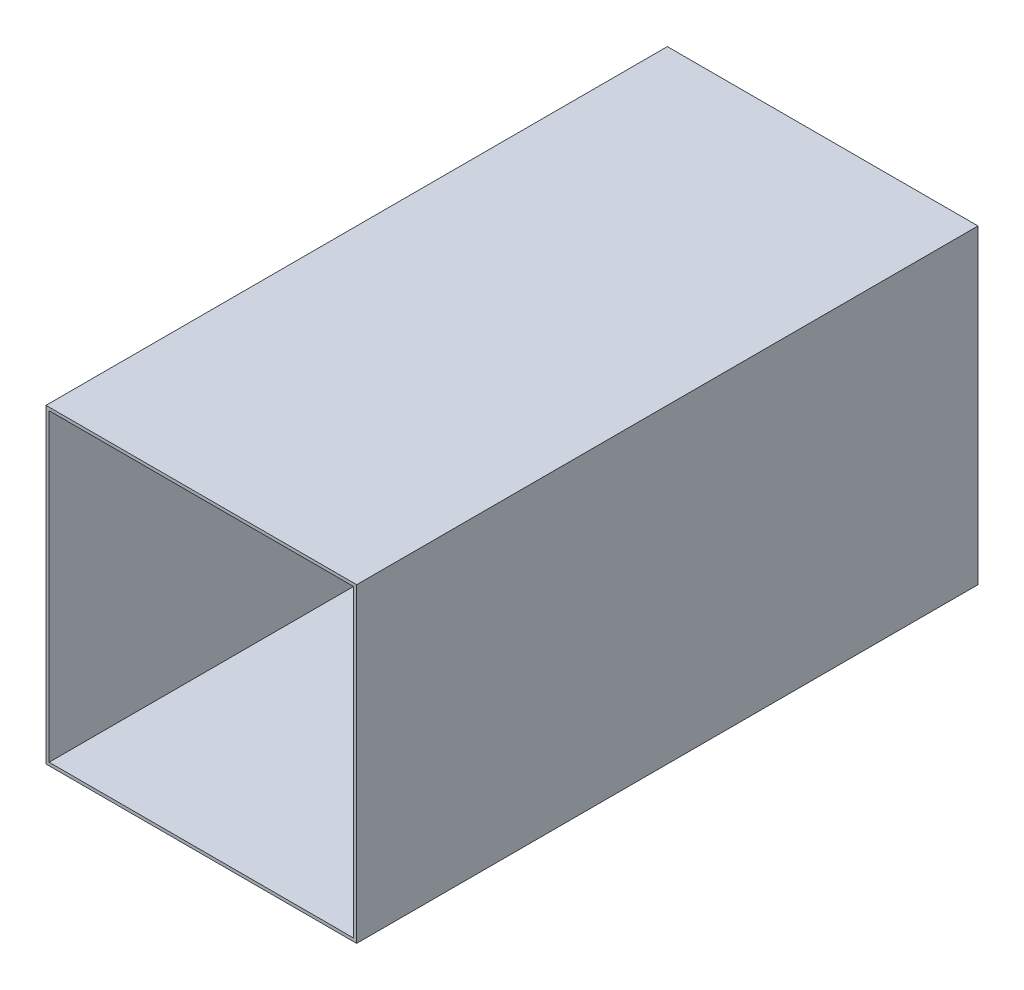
ISO-10303-21;
HEADER;
FILE_DESCRIPTION(('STEP AP214'),'2;1');
FILE_NAME('part.step','',(''),(''),'','','');
FILE_SCHEMA(('AUTOMOTIVE_DESIGN { 1 0 10303 214 1 1 1 1 }'));
ENDSEC;
DATA;
#1=APPLICATION_CONTEXT('core data for automotive mechanical design processes');
#2=APPLICATION_PROTOCOL_DEFINITION('international standard','automotive_design',2000,#1);
#3=PRODUCT_CONTEXT('',#1,'mechanical');
#4=PRODUCT('Part','Part','',(#3));
#5=PRODUCT_RELATED_PRODUCT_CATEGORY('part','',(#4));
#6=PRODUCT_DEFINITION_FORMATION('','',#4);
#7=PRODUCT_DEFINITION_CONTEXT('part definition',#1,'design');
#8=PRODUCT_DEFINITION('design','',#6,#7);
#9=PRODUCT_DEFINITION_SHAPE('','',#8);
#10=(LENGTH_UNIT() NAMED_UNIT(*) SI_UNIT(.MILLI.,.METRE.));
#11=(NAMED_UNIT(*) PLANE_ANGLE_UNIT() SI_UNIT($,.RADIAN.));
#12=(NAMED_UNIT(*) SI_UNIT($,.STERADIAN.) SOLID_ANGLE_UNIT());
#13=UNCERTAINTY_MEASURE_WITH_UNIT(LENGTH_MEASURE(1.E-05),#10,'distance_accuracy_value','');
#14=(GEOMETRIC_REPRESENTATION_CONTEXT(3) GLOBAL_UNCERTAINTY_ASSIGNED_CONTEXT((#13)) GLOBAL_UNIT_ASSIGNED_CONTEXT((#10,
#11,#12)) REPRESENTATION_CONTEXT('',''));
#15=CARTESIAN_POINT('',(0.,0.,0.));
#16=DIRECTION('',(0.,0.,1.));
#17=DIRECTION('',(1.,0.,0.));
#18=AXIS2_PLACEMENT_3D('',#15,#16,#17);
#19=CARTESIAN_POINT('',(0.,0.,254.));
#20=DIRECTION('',(0.,0.,-1.));
#21=DIRECTION('',(-1.,0.,0.));
#22=AXIS2_PLACEMENT_3D('',#19,#20,#21);
#23=PLANE('',#22);
#24=DIRECTION('',(0.,-1.,0.));
#25=VECTOR('',#24,1.);
#26=CARTESIAN_POINT('',(0.,0.,254.));
#27=LINE('',#26,#25);
#28=CARTESIAN_POINT('',(0.,254.,254.));
#29=VERTEX_POINT('',#28);
#30=CARTESIAN_POINT('',(0.,0.,254.));
#31=VERTEX_POINT('',#30);
#32=EDGE_CURVE('E133',#29,#31,#27,.T.);
#33=ORIENTED_EDGE('',*,*,#32,.T.);
#34=DIRECTION('',(1.,0.,0.));
#35=VECTOR('',#34,1.);
#36=CARTESIAN_POINT('',(0.,0.,254.));
#37=LINE('',#36,#35);
#38=CARTESIAN_POINT('',(254.,0.,254.));
#39=VERTEX_POINT('',#38);
#40=EDGE_CURVE('E136',#31,#39,#37,.T.);
#41=ORIENTED_EDGE('',*,*,#40,.T.);
#42=DIRECTION('',(0.,1.,0.));
#43=VECTOR('',#42,1.);
#44=CARTESIAN_POINT('',(254.,0.,254.));
#45=LINE('',#44,#43);
#46=CARTESIAN_POINT('',(254.,254.,254.));
#47=VERTEX_POINT('',#46);
#48=EDGE_CURVE('E139',#39,#47,#45,.T.);
#49=ORIENTED_EDGE('',*,*,#48,.T.);
#50=DIRECTION('',(-1.,0.,0.));
#51=VECTOR('',#50,1.);
#52=CARTESIAN_POINT('',(0.,254.,254.));
#53=LINE('',#52,#51);
#54=EDGE_CURVE('E141',#47,#29,#53,.T.);
#55=ORIENTED_EDGE('',*,*,#54,.T.);
#56=EDGE_LOOP('',(#33,#41,#49,#55));
#57=FACE_BOUND('',#56,.T.);
#58=DIRECTION('',(0.,-1.,0.));
#59=VECTOR('',#58,1.);
#60=CARTESIAN_POINT('',(2.54,2.54,254.));
#61=LINE('',#60,#59);
#62=CARTESIAN_POINT('',(2.54,251.46,254.));
#63=VERTEX_POINT('',#62);
#64=CARTESIAN_POINT('',(2.54,2.54,254.));
#65=VERTEX_POINT('',#64);
#66=EDGE_CURVE('E97',#63,#65,#61,.T.);
#67=ORIENTED_EDGE('',*,*,#66,.F.);
#68=DIRECTION('',(-1.,0.,0.));
#69=VECTOR('',#68,1.);
#70=CARTESIAN_POINT('',(2.54,251.46,254.));
#71=LINE('',#70,#69);
#72=CARTESIAN_POINT('',(251.46,251.46,254.));
#73=VERTEX_POINT('',#72);
#74=EDGE_CURVE('E119',#73,#63,#71,.T.);
#75=ORIENTED_EDGE('',*,*,#74,.F.);
#76=DIRECTION('',(0.,1.,0.));
#77=VECTOR('',#76,1.);
#78=CARTESIAN_POINT('',(251.46,2.54,254.));
#79=LINE('',#78,#77);
#80=CARTESIAN_POINT('',(251.46,2.54,254.));
#81=VERTEX_POINT('',#80);
#82=EDGE_CURVE('E117',#81,#73,#79,.T.);
#83=ORIENTED_EDGE('',*,*,#82,.F.);
#84=DIRECTION('',(1.,0.,0.));
#85=VECTOR('',#84,1.);
#86=CARTESIAN_POINT('',(2.54,2.54,254.));
#87=LINE('',#86,#85);
#88=EDGE_CURVE('E105',#65,#81,#87,.T.);
#89=ORIENTED_EDGE('',*,*,#88,.F.);
#90=EDGE_LOOP('',(#67,#75,#83,#89));
#91=FACE_BOUND('',#90,.T.);
#92=ADVANCED_FACE('F32',(#57,#91),#23,.F.);
#93=CARTESIAN_POINT('',(0.,0.,-254.));
#94=DIRECTION('',(0.,0.,-1.));
#95=DIRECTION('',(-1.,0.,0.));
#96=AXIS2_PLACEMENT_3D('',#93,#94,#95);
#97=PLANE('',#96);
#98=DIRECTION('',(0.,-1.,0.));
#99=VECTOR('',#98,1.);
#100=CARTESIAN_POINT('',(0.,0.,-254.));
#101=LINE('',#100,#99);
#102=CARTESIAN_POINT('',(0.,254.,-254.));
#103=VERTEX_POINT('',#102);
#104=CARTESIAN_POINT('',(0.,0.,-254.));
#105=VERTEX_POINT('',#104);
#106=EDGE_CURVE('E113',#103,#105,#101,.T.);
#107=ORIENTED_EDGE('',*,*,#106,.F.);
#108=DIRECTION('',(-1.,0.,0.));
#109=VECTOR('',#108,1.);
#110=CARTESIAN_POINT('',(0.,254.,-254.));
#111=LINE('',#110,#109);
#112=CARTESIAN_POINT('',(254.,254.,-254.));
#113=VERTEX_POINT('',#112);
#114=EDGE_CURVE('E137',#113,#103,#111,.T.);
#115=ORIENTED_EDGE('',*,*,#114,.F.);
#116=DIRECTION('',(0.,1.,0.));
#117=VECTOR('',#116,1.);
#118=CARTESIAN_POINT('',(254.,0.,-254.));
#119=LINE('',#118,#117);
#120=CARTESIAN_POINT('',(254.,0.,-254.));
#121=VERTEX_POINT('',#120);
#122=EDGE_CURVE('E148',#121,#113,#119,.T.);
#123=ORIENTED_EDGE('',*,*,#122,.F.);
#124=DIRECTION('',(1.,0.,0.));
#125=VECTOR('',#124,1.);
#126=CARTESIAN_POINT('',(0.,0.,-254.));
#127=LINE('',#126,#125);
#128=EDGE_CURVE('E146',#105,#121,#127,.T.);
#129=ORIENTED_EDGE('',*,*,#128,.F.);
#130=EDGE_LOOP('',(#107,#115,#123,#129));
#131=FACE_BOUND('',#130,.T.);
#132=DIRECTION('',(-1.,0.,0.));
#133=VECTOR('',#132,1.);
#134=CARTESIAN_POINT('',(2.54,251.46,-254.));
#135=LINE('',#134,#133);
#136=CARTESIAN_POINT('',(251.46,251.46,-254.));
#137=VERTEX_POINT('',#136);
#138=CARTESIAN_POINT('',(2.54,251.46,-254.));
#139=VERTEX_POINT('',#138);
#140=EDGE_CURVE('E106',#137,#139,#135,.T.);
#141=ORIENTED_EDGE('',*,*,#140,.T.);
#142=DIRECTION('',(0.,-1.,0.));
#143=VECTOR('',#142,1.);
#144=CARTESIAN_POINT('',(2.54,2.54,-254.));
#145=LINE('',#144,#143);
#146=CARTESIAN_POINT('',(2.54,2.54,-254.));
#147=VERTEX_POINT('',#146);
#148=EDGE_CURVE('E55',#139,#147,#145,.T.);
#149=ORIENTED_EDGE('',*,*,#148,.T.);
#150=DIRECTION('',(1.,0.,0.));
#151=VECTOR('',#150,1.);
#152=CARTESIAN_POINT('',(2.54,2.54,-254.));
#153=LINE('',#152,#151);
#154=CARTESIAN_POINT('',(251.46,2.54,-254.));
#155=VERTEX_POINT('',#154);
#156=EDGE_CURVE('E112',#147,#155,#153,.T.);
#157=ORIENTED_EDGE('',*,*,#156,.T.);
#158=DIRECTION('',(0.,1.,0.));
#159=VECTOR('',#158,1.);
#160=CARTESIAN_POINT('',(251.46,2.54,-254.));
#161=LINE('',#160,#159);
#162=EDGE_CURVE('E125',#155,#137,#161,.T.);
#163=ORIENTED_EDGE('',*,*,#162,.T.);
#164=EDGE_LOOP('',(#141,#149,#157,#163));
#165=FACE_BOUND('',#164,.T.);
#166=ADVANCED_FACE('F166',(#131,#165),#97,.T.);
#167=CARTESIAN_POINT('',(0.,0.,254.));
#168=DIRECTION('',(1.,0.,0.));
#169=DIRECTION('',(0.,0.,-1.));
#170=AXIS2_PLACEMENT_3D('',#167,#168,#169);
#171=PLANE('',#170);
#172=ORIENTED_EDGE('',*,*,#106,.T.);
#173=DIRECTION('',(0.,0.,-1.));
#174=VECTOR('',#173,1.);
#175=CARTESIAN_POINT('',(0.,0.,254.));
#176=LINE('',#175,#174);
#177=EDGE_CURVE('E11',#31,#105,#176,.T.);
#178=ORIENTED_EDGE('',*,*,#177,.F.);
#179=ORIENTED_EDGE('',*,*,#32,.F.);
#180=DIRECTION('',(0.,0.,-1.));
#181=VECTOR('',#180,1.);
#182=CARTESIAN_POINT('',(0.,254.,254.));
#183=LINE('',#182,#181);
#184=EDGE_CURVE('E143',#29,#103,#183,.T.);
#185=ORIENTED_EDGE('',*,*,#184,.T.);
#186=EDGE_LOOP('',(#172,#178,#179,#185));
#187=FACE_BOUND('',#186,.T.);
#188=ADVANCED_FACE('F34',(#187),#171,.F.);
#189=CARTESIAN_POINT('',(0.,0.,254.));
#190=DIRECTION('',(0.,1.,0.));
#191=DIRECTION('',(0.,0.,1.));
#192=AXIS2_PLACEMENT_3D('',#189,#190,#191);
#193=PLANE('',#192);
#194=ORIENTED_EDGE('',*,*,#128,.T.);
#195=DIRECTION('',(0.,0.,-1.));
#196=VECTOR('',#195,1.);
#197=CARTESIAN_POINT('',(254.,0.,254.));
#198=LINE('',#197,#196);
#199=EDGE_CURVE('E40',#39,#121,#198,.T.);
#200=ORIENTED_EDGE('',*,*,#199,.F.);
#201=ORIENTED_EDGE('',*,*,#40,.F.);
#202=ORIENTED_EDGE('',*,*,#177,.T.);
#203=EDGE_LOOP('',(#194,#200,#201,#202));
#204=FACE_BOUND('',#203,.T.);
#205=ADVANCED_FACE('F176',(#204),#193,.F.);
#206=CARTESIAN_POINT('',(254.,0.,254.));
#207=DIRECTION('',(-1.,0.,0.));
#208=DIRECTION('',(0.,0.,1.));
#209=AXIS2_PLACEMENT_3D('',#206,#207,#208);
#210=PLANE('',#209);
#211=ORIENTED_EDGE('',*,*,#122,.T.);
#212=DIRECTION('',(0.,0.,-1.));
#213=VECTOR('',#212,1.);
#214=CARTESIAN_POINT('',(254.,254.,254.));
#215=LINE('',#214,#213);
#216=EDGE_CURVE('E153',#47,#113,#215,.T.);
#217=ORIENTED_EDGE('',*,*,#216,.F.);
#218=ORIENTED_EDGE('',*,*,#48,.F.);
#219=ORIENTED_EDGE('',*,*,#199,.T.);
#220=EDGE_LOOP('',(#211,#217,#218,#219));
#221=FACE_BOUND('',#220,.T.);
#222=ADVANCED_FACE('F160',(#221),#210,.F.);
#223=CARTESIAN_POINT('',(0.,254.,254.));
#224=DIRECTION('',(0.,-1.,0.));
#225=DIRECTION('',(0.,0.,-1.));
#226=AXIS2_PLACEMENT_3D('',#223,#224,#225);
#227=PLANE('',#226);
#228=ORIENTED_EDGE('',*,*,#114,.T.);
#229=ORIENTED_EDGE('',*,*,#184,.F.);
#230=ORIENTED_EDGE('',*,*,#54,.F.);
#231=ORIENTED_EDGE('',*,*,#216,.T.);
#232=EDGE_LOOP('',(#228,#229,#230,#231));
#233=FACE_BOUND('',#232,.T.);
#234=ADVANCED_FACE('F170',(#233),#227,.F.);
#235=CARTESIAN_POINT('',(2.54,2.54,254.));
#236=DIRECTION('',(1.,0.,0.));
#237=DIRECTION('',(0.,0.,-1.));
#238=AXIS2_PLACEMENT_3D('',#235,#236,#237);
#239=PLANE('',#238);
#240=ORIENTED_EDGE('',*,*,#148,.F.);
#241=DIRECTION('',(0.,0.,-1.));
#242=VECTOR('',#241,1.);
#243=CARTESIAN_POINT('',(2.54,251.46,254.));
#244=LINE('',#243,#242);
#245=EDGE_CURVE('E101',#63,#139,#244,.T.);
#246=ORIENTED_EDGE('',*,*,#245,.F.);
#247=ORIENTED_EDGE('',*,*,#66,.T.);
#248=DIRECTION('',(0.,0.,-1.));
#249=VECTOR('',#248,1.);
#250=CARTESIAN_POINT('',(2.54,2.54,254.));
#251=LINE('',#250,#249);
#252=EDGE_CURVE('E100',#65,#147,#251,.T.);
#253=ORIENTED_EDGE('',*,*,#252,.T.);
#254=EDGE_LOOP('',(#240,#246,#247,#253));
#255=FACE_BOUND('',#254,.T.);
#256=ADVANCED_FACE('F99',(#255),#239,.T.);
#257=CARTESIAN_POINT('',(2.54,2.54,254.));
#258=DIRECTION('',(0.,1.,0.));
#259=DIRECTION('',(0.,0.,1.));
#260=AXIS2_PLACEMENT_3D('',#257,#258,#259);
#261=PLANE('',#260);
#262=ORIENTED_EDGE('',*,*,#156,.F.);
#263=ORIENTED_EDGE('',*,*,#252,.F.);
#264=ORIENTED_EDGE('',*,*,#88,.T.);
#265=DIRECTION('',(0.,0.,-1.));
#266=VECTOR('',#265,1.);
#267=CARTESIAN_POINT('',(251.46,2.54,254.));
#268=LINE('',#267,#266);
#269=EDGE_CURVE('E114',#81,#155,#268,.T.);
#270=ORIENTED_EDGE('',*,*,#269,.T.);
#271=EDGE_LOOP('',(#262,#263,#264,#270));
#272=FACE_BOUND('',#271,.T.);
#273=ADVANCED_FACE('F109',(#272),#261,.T.);
#274=CARTESIAN_POINT('',(251.46,2.54,254.));
#275=DIRECTION('',(-1.,0.,0.));
#276=DIRECTION('',(0.,0.,1.));
#277=AXIS2_PLACEMENT_3D('',#274,#275,#276);
#278=PLANE('',#277);
#279=ORIENTED_EDGE('',*,*,#162,.F.);
#280=ORIENTED_EDGE('',*,*,#269,.F.);
#281=ORIENTED_EDGE('',*,*,#82,.T.);
#282=DIRECTION('',(0.,0.,-1.));
#283=VECTOR('',#282,1.);
#284=CARTESIAN_POINT('',(251.46,251.46,254.));
#285=LINE('',#284,#283);
#286=EDGE_CURVE('E47',#73,#137,#285,.T.);
#287=ORIENTED_EDGE('',*,*,#286,.T.);
#288=EDGE_LOOP('',(#279,#280,#281,#287));
#289=FACE_BOUND('',#288,.T.);
#290=ADVANCED_FACE('F199',(#289),#278,.T.);
#291=CARTESIAN_POINT('',(2.54,251.46,254.));
#292=DIRECTION('',(0.,-1.,0.));
#293=DIRECTION('',(0.,0.,-1.));
#294=AXIS2_PLACEMENT_3D('',#291,#292,#293);
#295=PLANE('',#294);
#296=ORIENTED_EDGE('',*,*,#140,.F.);
#297=ORIENTED_EDGE('',*,*,#286,.F.);
#298=ORIENTED_EDGE('',*,*,#74,.T.);
#299=ORIENTED_EDGE('',*,*,#245,.T.);
#300=EDGE_LOOP('',(#296,#297,#298,#299));
#301=FACE_BOUND('',#300,.T.);
#302=ADVANCED_FACE('F203',(#301),#295,.T.);
#303=CLOSED_SHELL('',(#92,#166,#188,#205,#222,#234,#256,#273,#290,#302));
#304=MANIFOLD_SOLID_BREP('B2',#303);
#305=ADVANCED_BREP_SHAPE_REPRESENTATION('',(#18,#304),#14);
#306=SHAPE_DEFINITION_REPRESENTATION(#9,#305);
ENDSEC;
END-ISO-10303-21;
